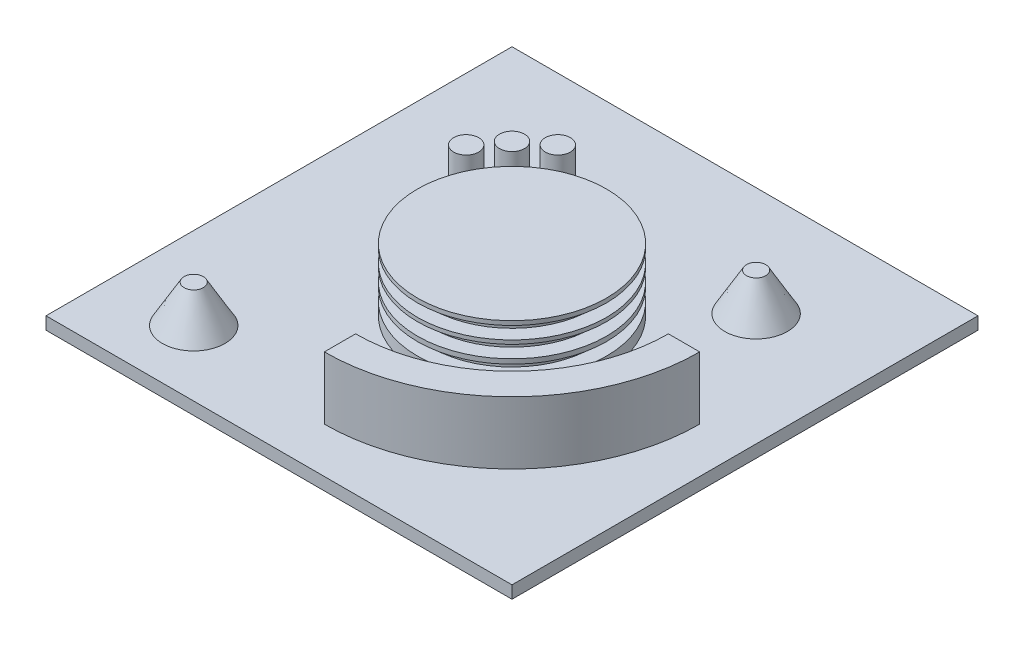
from build123d import *

# Parameters (mm, degrees)
SKETCH1_W                     = 94.592545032
SKETCH1_H                     = 94.592545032
EXTRUDE1_DEPTH                = 2.54
SKETCH2_R                     = 19.185004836
SKETCH2_R_2                   = 2.54
EXTRUDE2_DEPTH                = 12.7
SKETCH3_R                     = 6.35
BOSS_EXTRUDE1_DEPTH           = 7.62
BOSS_EXTRUDE1_DRAFT           = 30
BOSS_EXTRUDE1_PROFILE_2_DEPTH = 7.62
BOSS_EXTRUDE1_PROFILE_2_DRAFT = 30
SKETCH5_W                     = 6.530397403
SKETCH5_H                     = 2.54


with BuildPart() as part:
    # Sketch1 → Extrude1 (new body)
    with BuildSketch(Plane(origin=(0, 0, 0), x_dir=(1, 0, 0), z_dir=(0, 1, 0))):
        Rectangle(SKETCH1_W, SKETCH1_H)
    extrude(amount=EXTRUDE1_DEPTH)

    # Sketch2 → Extrude2 (add)
    with BuildSketch(Plane(origin=(0, 2.54, 0), x_dir=(-1, 0, 0), z_dir=(0, 1, 0))):
        with Locations(Location((0, 0, 0), (0, 0, 270))):
            Circle(SKETCH2_R)
        with Locations(Location((12.7, -21.997045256, 0), (0, 0, 270))):
            Circle(SKETCH2_R_2)
        with Locations(Location((17.960512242, -17.960512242, 0), (0, 0, 270))):
            Circle(SKETCH2_R_2)
        with Locations(Location((21.997045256, -12.7, 0), (0, 0, 270))):
            Circle(SKETCH2_R_2)
        with BuildLine():
            Line((0, 31.75), (0, 38.1))
            ThreePointArc((0, 38.1), (-26.940768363, 26.940768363), (-38.1, 0))
            Line((-38.1, 0), (-31.75, 0))
            ThreePointArc((-31.75, 0), (-22.450640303, 22.450640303), (0, 31.75))
        make_face()
    extrude(amount=EXTRUDE2_DEPTH)


with BuildPart() as boss_extrude1_tool:
    # Sketch3 → Boss-Extrude1 (with draft: the straight prism first)
    with BuildSketch(Plane(origin=(0, 2.54, 0), x_dir=(1, 0, 0), z_dir=(0, 1, 0))):
        with Locations((24.376816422, 25.181660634)):
            Circle(SKETCH3_R)
    extrude(amount=BOSS_EXTRUDE1_DEPTH)
    # Boss-Extrude1: the draft: its side faces are tilted about the plane it starts from
    boss_extrude1_sides = [boss_extrude1_tool.faces().sort_by_distance(p)[0] for p in [
        (18.026816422, 6.35, -25.181660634),
    ]]
    draft(boss_extrude1_sides, Plane(origin=(0, 2.54, 0), x_dir=(1, 0, 0), z_dir=(0, 1, 0)), BOSS_EXTRUDE1_DRAFT)


with BuildPart() as part_1:
    add(part.part)

    # Boss-Extrude1: add boss_extrude1_tool
    add(boss_extrude1_tool.part)


with BuildPart() as boss_extrude1_profile_2_tool:
    # Sketch3 → Boss-Extrude1 profile 2 (with draft: the straight prism first)
    with BuildSketch(Plane(origin=(0, 2.54, 0), x_dir=(1, 0, 0), z_dir=(0, 1, 0))):
        with Locations((-30.602766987, -34.00792177)):
            Circle(SKETCH3_R)
    extrude(amount=BOSS_EXTRUDE1_PROFILE_2_DEPTH)
    # Boss-Extrude1 profile 2: the draft: its side faces are tilted about the plane it starts from
    boss_extrude1_profile_2_sides = [boss_extrude1_profile_2_tool.faces().sort_by_distance(p)[0] for p in [
        (-36.952766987, 6.35, 34.00792177),
    ]]
    draft(boss_extrude1_profile_2_sides, Plane(origin=(0, 2.54, 0), x_dir=(1, 0, 0), z_dir=(0, 1, 0)), BOSS_EXTRUDE1_PROFILE_2_DRAFT)


with BuildPart() as part_2:
    add(part_1.part)

    # Boss-Extrude1 profile 2: add boss_extrude1_profile_2_tool
    add(boss_extrude1_profile_2_tool.part)

    # Sketch5 → Cut-Revolve1 (revolve, cut)
    with BuildSketch(Plane(origin=(0, 0, 0), x_dir=(0, 0, -1), z_dir=(1, 0, 0))):
        with Locations((19.56198712, 13.12219059)):
            Rectangle(SKETCH5_W, SKETCH5_H)
        with Locations((19.56198712, 9.810298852)):
            Rectangle(SKETCH5_W, SKETCH5_H)
        with Locations((19.56198712, 6.317205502)):
            Rectangle(SKETCH5_W, SKETCH5_H)
    revolve(axis=Axis((0, 15.24, 0), (0, -1, 0)), mode=Mode.SUBTRACT)


solid = part_2.part
